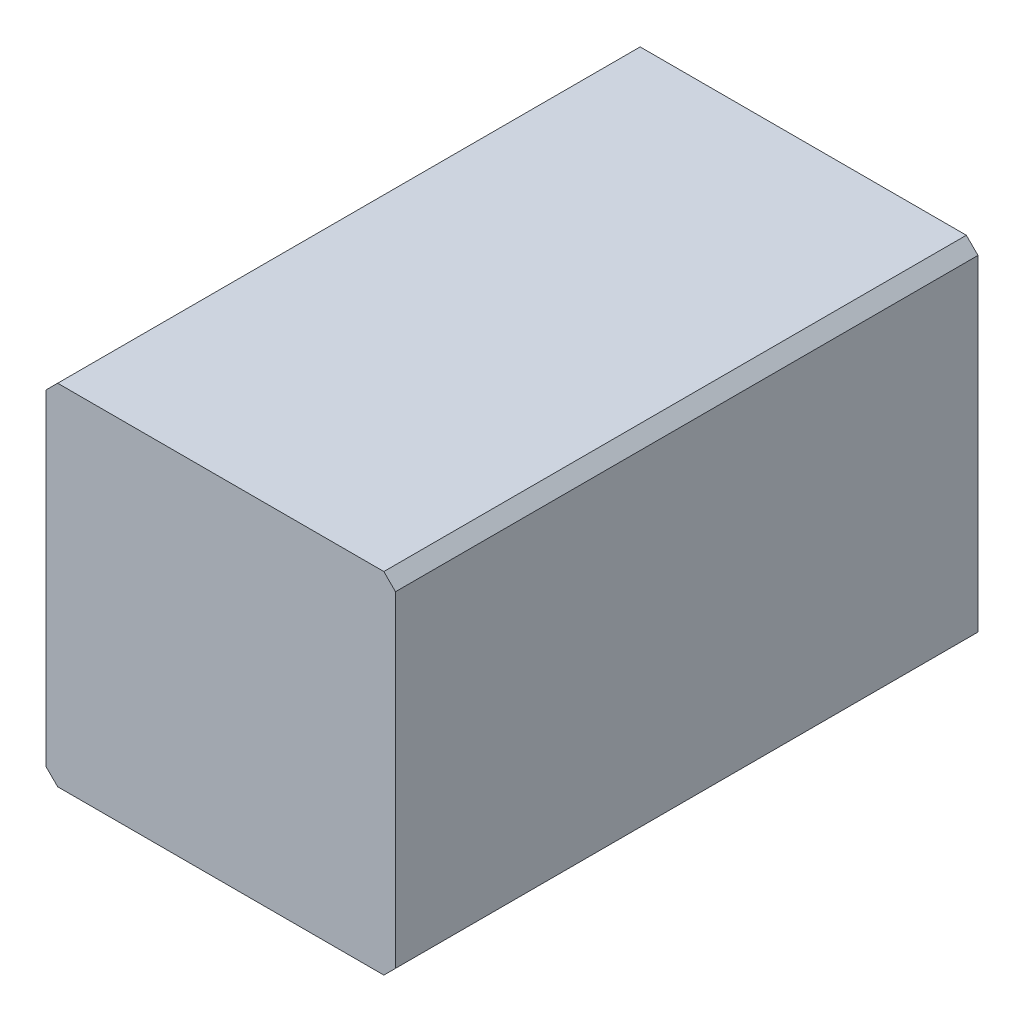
from build123d import *

# Parameters (mm, degrees)
ESQUISSE1_W      = 6
ESQUISSE1_H      = 6
EXTRUSION1_DEPTH = 5
CHANFREIN1_SIZE  = 0.2


with BuildPart() as part:
    # Esquisse1 → Extrusion1 (new, symmetric)
    with BuildSketch(Plane.XY):
        Rectangle(ESQUISSE1_W, ESQUISSE1_H)
    extrude(amount=EXTRUSION1_DEPTH, both=True)

    # Chanfrein1
    chanfrein1_edges = [part.edges().sort_by_distance(p)[0] for p in [
        (-3, 3, 0),
        (3, 3, 0),
        (3, -3, 0),
        (-3, -3, 0),
    ]]
    chamfer(chanfrein1_edges, length=CHANFREIN1_SIZE)


solid = part.part
